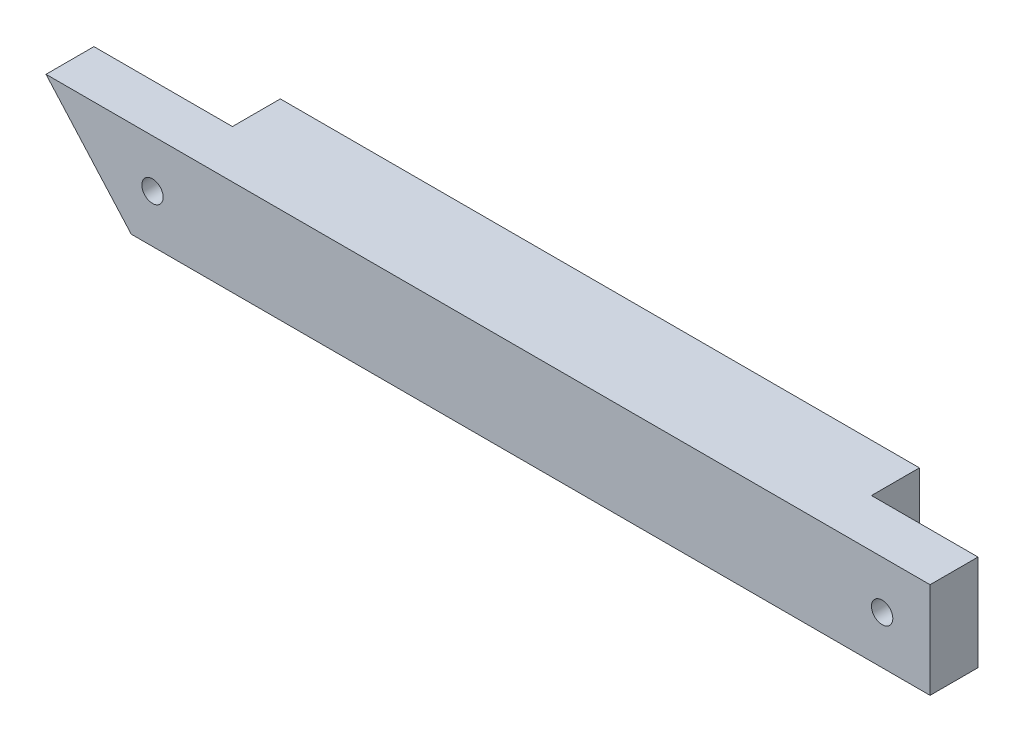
ISO-10303-21;
HEADER;
FILE_DESCRIPTION(('STEP AP214'),'2;1');
FILE_NAME('part.step','',(''),(''),'','','');
FILE_SCHEMA(('AUTOMOTIVE_DESIGN { 1 0 10303 214 1 1 1 1 }'));
ENDSEC;
DATA;
#1=APPLICATION_CONTEXT('core data for automotive mechanical design processes');
#2=APPLICATION_PROTOCOL_DEFINITION('international standard','automotive_design',2000,#1);
#3=PRODUCT_CONTEXT('',#1,'mechanical');
#4=PRODUCT('Part','Part','',(#3));
#5=PRODUCT_RELATED_PRODUCT_CATEGORY('part','',(#4));
#6=PRODUCT_DEFINITION_FORMATION('','',#4);
#7=PRODUCT_DEFINITION_CONTEXT('part definition',#1,'design');
#8=PRODUCT_DEFINITION('design','',#6,#7);
#9=PRODUCT_DEFINITION_SHAPE('','',#8);
#10=(LENGTH_UNIT() NAMED_UNIT(*) SI_UNIT(.MILLI.,.METRE.));
#11=(NAMED_UNIT(*) PLANE_ANGLE_UNIT() SI_UNIT($,.RADIAN.));
#12=(NAMED_UNIT(*) SI_UNIT($,.STERADIAN.) SOLID_ANGLE_UNIT());
#13=UNCERTAINTY_MEASURE_WITH_UNIT(LENGTH_MEASURE(1.E-05),#10,'distance_accuracy_value','');
#14=(GEOMETRIC_REPRESENTATION_CONTEXT(3) GLOBAL_UNCERTAINTY_ASSIGNED_CONTEXT((#13)) GLOBAL_UNIT_ASSIGNED_CONTEXT((#10,
#11,#12)) REPRESENTATION_CONTEXT('',''));
#15=CARTESIAN_POINT('',(0.,0.,0.));
#16=DIRECTION('',(0.,0.,1.));
#17=DIRECTION('',(1.,0.,0.));
#18=AXIS2_PLACEMENT_3D('',#15,#16,#17);
#19=CARTESIAN_POINT('',(0.,9.,9.));
#20=DIRECTION('',(0.74740931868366,0.66436383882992,0.));
#21=DIRECTION('',(-0.66436383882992,0.74740931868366,0.));
#22=AXIS2_PLACEMENT_3D('',#19,#20,#21);
#23=PLANE('',#22);
#24=DIRECTION('',(-0.66436383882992,0.74740931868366,0.));
#25=VECTOR('',#24,1.);
#26=CARTESIAN_POINT('',(8.,0.,4.5));
#27=LINE('',#26,#25);
#28=CARTESIAN_POINT('',(8.,0.,4.5));
#29=VERTEX_POINT('',#28);
#30=CARTESIAN_POINT('',(0.,9.,4.5));
#31=VERTEX_POINT('',#30);
#32=EDGE_CURVE('E97',#29,#31,#27,.T.);
#33=ORIENTED_EDGE('',*,*,#32,.F.);
#34=DIRECTION('',(0.,0.,-1.));
#35=VECTOR('',#34,1.);
#36=CARTESIAN_POINT('',(8.,0.,9.));
#37=LINE('',#36,#35);
#38=CARTESIAN_POINT('',(8.,0.,9.));
#39=VERTEX_POINT('',#38);
#40=EDGE_CURVE('E152',#39,#29,#37,.T.);
#41=ORIENTED_EDGE('',*,*,#40,.F.);
#42=DIRECTION('',(0.66436383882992,-0.74740931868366,0.));
#43=VECTOR('',#42,1.);
#44=CARTESIAN_POINT('',(0.,9.,9.));
#45=LINE('',#44,#43);
#46=CARTESIAN_POINT('',(0.,9.,9.));
#47=VERTEX_POINT('',#46);
#48=EDGE_CURVE('E117',#47,#39,#45,.T.);
#49=ORIENTED_EDGE('',*,*,#48,.F.);
#50=DIRECTION('',(0.,0.,-1.));
#51=VECTOR('',#50,1.);
#52=CARTESIAN_POINT('',(0.,9.,9.));
#53=LINE('',#52,#51);
#54=EDGE_CURVE('E112',#47,#31,#53,.T.);
#55=ORIENTED_EDGE('',*,*,#54,.T.);
#56=EDGE_LOOP('',(#33,#41,#49,#55));
#57=FACE_BOUND('',#56,.T.);
#58=ADVANCED_FACE('F31',(#57),#23,.F.);
#59=CARTESIAN_POINT('',(0.,0.,9.));
#60=DIRECTION('',(0.,1.,0.));
#61=DIRECTION('',(0.,0.,1.));
#62=AXIS2_PLACEMENT_3D('',#59,#60,#61);
#63=PLANE('',#62);
#64=DIRECTION('',(-1.,0.,0.));
#65=VECTOR('',#64,1.);
#66=CARTESIAN_POINT('',(21.,0.,4.5));
#67=LINE('',#66,#65);
#68=CARTESIAN_POINT('',(21.,0.,4.5));
#69=VERTEX_POINT('',#68);
#70=EDGE_CURVE('E46',#69,#29,#67,.T.);
#71=ORIENTED_EDGE('',*,*,#70,.F.);
#72=DIRECTION('',(0.,0.,-1.));
#73=VECTOR('',#72,1.);
#74=CARTESIAN_POINT('',(21.,0.,4.5));
#75=LINE('',#74,#73);
#76=CARTESIAN_POINT('',(21.,0.,0.));
#77=VERTEX_POINT('',#76);
#78=EDGE_CURVE('E157',#69,#77,#75,.T.);
#79=ORIENTED_EDGE('',*,*,#78,.T.);
#80=DIRECTION('',(1.,0.,0.));
#81=VECTOR('',#80,1.);
#82=CARTESIAN_POINT('',(0.,0.,0.));
#83=LINE('',#82,#81);
#84=CARTESIAN_POINT('',(73.,0.,0.));
#85=VERTEX_POINT('',#84);
#86=EDGE_CURVE('E54',#77,#85,#83,.T.);
#87=ORIENTED_EDGE('',*,*,#86,.T.);
#88=DIRECTION('',(0.,0.,-1.));
#89=VECTOR('',#88,1.);
#90=CARTESIAN_POINT('',(73.,0.,4.5));
#91=LINE('',#90,#89);
#92=CARTESIAN_POINT('',(73.,0.,4.5));
#93=VERTEX_POINT('',#92);
#94=EDGE_CURVE('E132',#93,#85,#91,.T.);
#95=ORIENTED_EDGE('',*,*,#94,.F.);
#96=DIRECTION('',(-1.,0.,0.));
#97=VECTOR('',#96,1.);
#98=CARTESIAN_POINT('',(83.,0.,4.5));
#99=LINE('',#98,#97);
#100=CARTESIAN_POINT('',(83.,0.,4.5));
#101=VERTEX_POINT('',#100);
#102=EDGE_CURVE('E145',#101,#93,#99,.T.);
#103=ORIENTED_EDGE('',*,*,#102,.F.);
#104=DIRECTION('',(0.,0.,-1.));
#105=VECTOR('',#104,1.);
#106=CARTESIAN_POINT('',(83.,0.,9.));
#107=LINE('',#106,#105);
#108=CARTESIAN_POINT('',(83.,0.,9.));
#109=VERTEX_POINT('',#108);
#110=EDGE_CURVE('E11',#109,#101,#107,.T.);
#111=ORIENTED_EDGE('',*,*,#110,.F.);
#112=DIRECTION('',(1.,0.,0.));
#113=VECTOR('',#112,1.);
#114=CARTESIAN_POINT('',(0.,0.,9.));
#115=LINE('',#114,#113);
#116=EDGE_CURVE('E127',#39,#109,#115,.T.);
#117=ORIENTED_EDGE('',*,*,#116,.F.);
#118=ORIENTED_EDGE('',*,*,#40,.T.);
#119=EDGE_LOOP('',(#71,#79,#87,#95,#103,#111,#117,#118));
#120=FACE_BOUND('',#119,.T.);
#121=ADVANCED_FACE('F33',(#120),#63,.F.);
#122=CARTESIAN_POINT('',(83.,0.,9.));
#123=DIRECTION('',(-1.,0.,0.));
#124=DIRECTION('',(0.,0.,1.));
#125=AXIS2_PLACEMENT_3D('',#122,#123,#124);
#126=PLANE('',#125);
#127=ORIENTED_EDGE('',*,*,#110,.T.);
#128=DIRECTION('',(0.,-1.,0.));
#129=VECTOR('',#128,1.);
#130=CARTESIAN_POINT('',(83.,0.,4.5));
#131=LINE('',#130,#129);
#132=CARTESIAN_POINT('',(83.,9.,4.5));
#133=VERTEX_POINT('',#132);
#134=EDGE_CURVE('E139',#133,#101,#131,.T.);
#135=ORIENTED_EDGE('',*,*,#134,.F.);
#136=DIRECTION('',(0.,0.,-1.));
#137=VECTOR('',#136,1.);
#138=CARTESIAN_POINT('',(83.,9.,9.));
#139=LINE('',#138,#137);
#140=CARTESIAN_POINT('',(83.,9.,9.));
#141=VERTEX_POINT('',#140);
#142=EDGE_CURVE('E39',#141,#133,#139,.T.);
#143=ORIENTED_EDGE('',*,*,#142,.F.);
#144=DIRECTION('',(0.,1.,0.));
#145=VECTOR('',#144,1.);
#146=CARTESIAN_POINT('',(83.,0.,9.));
#147=LINE('',#146,#145);
#148=EDGE_CURVE('E122',#109,#141,#147,.T.);
#149=ORIENTED_EDGE('',*,*,#148,.F.);
#150=EDGE_LOOP('',(#127,#135,#143,#149));
#151=FACE_BOUND('',#150,.T.);
#152=ADVANCED_FACE('F193',(#151),#126,.F.);
#153=CARTESIAN_POINT('',(0.,9.,9.));
#154=DIRECTION('',(0.,-1.,0.));
#155=DIRECTION('',(0.,0.,-1.));
#156=AXIS2_PLACEMENT_3D('',#153,#154,#155);
#157=PLANE('',#156);
#158=DIRECTION('',(-1.,0.,0.));
#159=VECTOR('',#158,1.);
#160=CARTESIAN_POINT('',(0.,9.,0.));
#161=LINE('',#160,#159);
#162=CARTESIAN_POINT('',(73.,9.,0.));
#163=VERTEX_POINT('',#162);
#164=CARTESIAN_POINT('',(13.,9.,0.));
#165=VERTEX_POINT('',#164);
#166=EDGE_CURVE('E125',#163,#165,#161,.T.);
#167=ORIENTED_EDGE('',*,*,#166,.T.);
#168=DIRECTION('',(0.,0.,-1.));
#169=VECTOR('',#168,1.);
#170=CARTESIAN_POINT('',(13.,9.,4.5));
#171=LINE('',#170,#169);
#172=CARTESIAN_POINT('',(13.,9.,4.5));
#173=VERTEX_POINT('',#172);
#174=EDGE_CURVE('E113',#173,#165,#171,.T.);
#175=ORIENTED_EDGE('',*,*,#174,.F.);
#176=DIRECTION('',(1.,0.,0.));
#177=VECTOR('',#176,1.);
#178=CARTESIAN_POINT('',(0.,9.,4.5));
#179=LINE('',#178,#177);
#180=EDGE_CURVE('E100',#31,#173,#179,.T.);
#181=ORIENTED_EDGE('',*,*,#180,.F.);
#182=ORIENTED_EDGE('',*,*,#54,.F.);
#183=DIRECTION('',(-1.,0.,0.));
#184=VECTOR('',#183,1.);
#185=CARTESIAN_POINT('',(0.,9.,9.));
#186=LINE('',#185,#184);
#187=EDGE_CURVE('E119',#141,#47,#186,.T.);
#188=ORIENTED_EDGE('',*,*,#187,.F.);
#189=ORIENTED_EDGE('',*,*,#142,.T.);
#190=DIRECTION('',(1.,0.,0.));
#191=VECTOR('',#190,1.);
#192=CARTESIAN_POINT('',(83.,9.,4.5));
#193=LINE('',#192,#191);
#194=CARTESIAN_POINT('',(73.,9.,4.5));
#195=VERTEX_POINT('',#194);
#196=EDGE_CURVE('E134',#195,#133,#193,.T.);
#197=ORIENTED_EDGE('',*,*,#196,.F.);
#198=DIRECTION('',(0.,0.,-1.));
#199=VECTOR('',#198,1.);
#200=CARTESIAN_POINT('',(73.,9.,4.5));
#201=LINE('',#200,#199);
#202=EDGE_CURVE('E128',#195,#163,#201,.T.);
#203=ORIENTED_EDGE('',*,*,#202,.T.);
#204=EDGE_LOOP('',(#167,#175,#181,#182,#188,#189,#197,#203));
#205=FACE_BOUND('',#204,.T.);
#206=ADVANCED_FACE('F110',(#205),#157,.F.);
#207=CARTESIAN_POINT('',(0.,9.,9.));
#208=DIRECTION('',(0.,0.,-1.));
#209=DIRECTION('',(-1.,0.,0.));
#210=AXIS2_PLACEMENT_3D('',#207,#208,#209);
#211=PLANE('',#210);
#212=CARTESIAN_POINT('',(10.,4.5,9.));
#213=DIRECTION('',(0.,0.,-1.));
#214=DIRECTION('',(-1.,0.,0.));
#215=AXIS2_PLACEMENT_3D('',#212,#213,#214);
#216=CIRCLE('',#215,1.);
#217=CARTESIAN_POINT('',(9.,4.5,9.));
#218=VERTEX_POINT('',#217);
#219=EDGE_CURVE('E161',#218,#218,#216,.T.);
#220=ORIENTED_EDGE('',*,*,#219,.T.);
#221=EDGE_LOOP('',(#220));
#222=FACE_BOUND('',#221,.T.);
#223=CARTESIAN_POINT('',(78.5,4.5,9.));
#224=DIRECTION('',(0.,0.,-1.));
#225=DIRECTION('',(-1.,0.,0.));
#226=AXIS2_PLACEMENT_3D('',#223,#224,#225);
#227=CIRCLE('',#226,0.999999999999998);
#228=CARTESIAN_POINT('',(77.5,4.5,9.));
#229=VERTEX_POINT('',#228);
#230=EDGE_CURVE('E140',#229,#229,#227,.T.);
#231=ORIENTED_EDGE('',*,*,#230,.T.);
#232=EDGE_LOOP('',(#231));
#233=FACE_BOUND('',#232,.T.);
#234=ORIENTED_EDGE('',*,*,#187,.T.);
#235=ORIENTED_EDGE('',*,*,#48,.T.);
#236=ORIENTED_EDGE('',*,*,#116,.T.);
#237=ORIENTED_EDGE('',*,*,#148,.T.);
#238=EDGE_LOOP('',(#234,#235,#236,#237));
#239=FACE_BOUND('',#238,.T.);
#240=ADVANCED_FACE('F170',(#222,#233,#239),#211,.F.);
#241=CARTESIAN_POINT('',(0.,9.,0.));
#242=DIRECTION('',(0.,0.,-1.));
#243=DIRECTION('',(-1.,0.,0.));
#244=AXIS2_PLACEMENT_3D('',#241,#242,#243);
#245=PLANE('',#244);
#246=DIRECTION('',(0.66436383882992,-0.74740931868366,0.));
#247=VECTOR('',#246,1.);
#248=CARTESIAN_POINT('',(13.,9.,0.));
#249=LINE('',#248,#247);
#250=EDGE_CURVE('E105',#165,#77,#249,.T.);
#251=ORIENTED_EDGE('',*,*,#250,.F.);
#252=ORIENTED_EDGE('',*,*,#166,.F.);
#253=DIRECTION('',(0.,1.,0.));
#254=VECTOR('',#253,1.);
#255=CARTESIAN_POINT('',(73.,0.,0.));
#256=LINE('',#255,#254);
#257=EDGE_CURVE('E137',#85,#163,#256,.T.);
#258=ORIENTED_EDGE('',*,*,#257,.F.);
#259=ORIENTED_EDGE('',*,*,#86,.F.);
#260=EDGE_LOOP('',(#251,#252,#258,#259));
#261=FACE_BOUND('',#260,.T.);
#262=ADVANCED_FACE('F205',(#261),#245,.T.);
#263=CARTESIAN_POINT('',(73.,0.,4.5));
#264=DIRECTION('',(-1.,0.,0.));
#265=DIRECTION('',(0.,0.,1.));
#266=AXIS2_PLACEMENT_3D('',#263,#264,#265);
#267=PLANE('',#266);
#268=ORIENTED_EDGE('',*,*,#257,.T.);
#269=ORIENTED_EDGE('',*,*,#202,.F.);
#270=DIRECTION('',(0.,1.,0.));
#271=VECTOR('',#270,1.);
#272=CARTESIAN_POINT('',(73.,0.,4.5));
#273=LINE('',#272,#271);
#274=EDGE_CURVE('E142',#93,#195,#273,.T.);
#275=ORIENTED_EDGE('',*,*,#274,.F.);
#276=ORIENTED_EDGE('',*,*,#94,.T.);
#277=EDGE_LOOP('',(#268,#269,#275,#276));
#278=FACE_BOUND('',#277,.T.);
#279=ADVANCED_FACE('F201',(#278),#267,.F.);
#280=CARTESIAN_POINT('',(83.,9.,4.5));
#281=DIRECTION('',(0.,0.,1.));
#282=DIRECTION('',(1.,0.,0.));
#283=AXIS2_PLACEMENT_3D('',#280,#281,#282);
#284=PLANE('',#283);
#285=CARTESIAN_POINT('',(78.5,4.5,4.5));
#286=DIRECTION('',(0.,0.,-1.));
#287=DIRECTION('',(-1.,0.,0.));
#288=AXIS2_PLACEMENT_3D('',#285,#286,#287);
#289=CIRCLE('',#288,0.999999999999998);
#290=CARTESIAN_POINT('',(77.5,4.5,4.5));
#291=VERTEX_POINT('',#290);
#292=EDGE_CURVE('E149',#291,#291,#289,.T.);
#293=ORIENTED_EDGE('',*,*,#292,.F.);
#294=EDGE_LOOP('',(#293));
#295=FACE_BOUND('',#294,.T.);
#296=ORIENTED_EDGE('',*,*,#134,.T.);
#297=ORIENTED_EDGE('',*,*,#102,.T.);
#298=ORIENTED_EDGE('',*,*,#274,.T.);
#299=ORIENTED_EDGE('',*,*,#196,.T.);
#300=EDGE_LOOP('',(#296,#297,#298,#299));
#301=FACE_BOUND('',#300,.T.);
#302=ADVANCED_FACE('F197',(#295,#301),#284,.F.);
#303=CARTESIAN_POINT('',(78.5,4.5,9.));
#304=DIRECTION('',(0.,0.,-1.));
#305=DIRECTION('',(-1.,0.,0.));
#306=AXIS2_PLACEMENT_3D('',#303,#304,#305);
#307=CYLINDRICAL_SURFACE('',#306,0.999999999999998);
#308=ORIENTED_EDGE('',*,*,#230,.F.);
#309=EDGE_LOOP('',(#308));
#310=FACE_BOUND('',#309,.T.);
#311=ORIENTED_EDGE('',*,*,#292,.T.);
#312=EDGE_LOOP('',(#311));
#313=FACE_BOUND('',#312,.T.);
#314=ADVANCED_FACE('F185',(#310,#313),#307,.F.);
#315=CARTESIAN_POINT('',(13.,9.,4.5));
#316=DIRECTION('',(0.74740931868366,0.66436383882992,0.));
#317=DIRECTION('',(-0.66436383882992,0.74740931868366,0.));
#318=AXIS2_PLACEMENT_3D('',#315,#316,#317);
#319=PLANE('',#318);
#320=ORIENTED_EDGE('',*,*,#250,.T.);
#321=ORIENTED_EDGE('',*,*,#78,.F.);
#322=DIRECTION('',(0.66436383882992,-0.74740931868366,0.));
#323=VECTOR('',#322,1.);
#324=CARTESIAN_POINT('',(13.,9.,4.5));
#325=LINE('',#324,#323);
#326=EDGE_CURVE('E114',#173,#69,#325,.T.);
#327=ORIENTED_EDGE('',*,*,#326,.F.);
#328=ORIENTED_EDGE('',*,*,#174,.T.);
#329=EDGE_LOOP('',(#320,#321,#327,#328));
#330=FACE_BOUND('',#329,.T.);
#331=ADVANCED_FACE('F180',(#330),#319,.F.);
#332=CARTESIAN_POINT('',(0.,9.,4.5));
#333=DIRECTION('',(0.,0.,-1.));
#334=DIRECTION('',(-1.,0.,0.));
#335=AXIS2_PLACEMENT_3D('',#332,#333,#334);
#336=PLANE('',#335);
#337=CARTESIAN_POINT('',(10.,4.5,4.5));
#338=DIRECTION('',(0.,0.,-1.));
#339=DIRECTION('',(-1.,0.,0.));
#340=AXIS2_PLACEMENT_3D('',#337,#338,#339);
#341=CIRCLE('',#340,1.);
#342=CARTESIAN_POINT('',(9.,4.5,4.5));
#343=VERTEX_POINT('',#342);
#344=EDGE_CURVE('E164',#343,#343,#341,.T.);
#345=ORIENTED_EDGE('',*,*,#344,.F.);
#346=EDGE_LOOP('',(#345));
#347=FACE_BOUND('',#346,.T.);
#348=ORIENTED_EDGE('',*,*,#32,.T.);
#349=ORIENTED_EDGE('',*,*,#180,.T.);
#350=ORIENTED_EDGE('',*,*,#326,.T.);
#351=ORIENTED_EDGE('',*,*,#70,.T.);
#352=EDGE_LOOP('',(#348,#349,#350,#351));
#353=FACE_BOUND('',#352,.T.);
#354=ADVANCED_FACE('F99',(#347,#353),#336,.T.);
#355=CARTESIAN_POINT('',(10.,4.5,9.));
#356=DIRECTION('',(0.,0.,-1.));
#357=DIRECTION('',(-1.,0.,0.));
#358=AXIS2_PLACEMENT_3D('',#355,#356,#357);
#359=CYLINDRICAL_SURFACE('',#358,1.);
#360=ORIENTED_EDGE('',*,*,#219,.F.);
#361=EDGE_LOOP('',(#360));
#362=FACE_BOUND('',#361,.T.);
#363=ORIENTED_EDGE('',*,*,#344,.T.);
#364=EDGE_LOOP('',(#363));
#365=FACE_BOUND('',#364,.T.);
#366=ADVANCED_FACE('F173',(#362,#365),#359,.F.);
#367=CLOSED_SHELL('',(#58,#121,#152,#206,#240,#262,#279,#302,#314,#331,#354,#366));
#368=MANIFOLD_SOLID_BREP('B2',#367);
#369=ADVANCED_BREP_SHAPE_REPRESENTATION('',(#18,#368),#14);
#370=SHAPE_DEFINITION_REPRESENTATION(#9,#369);
ENDSEC;
END-ISO-10303-21;
